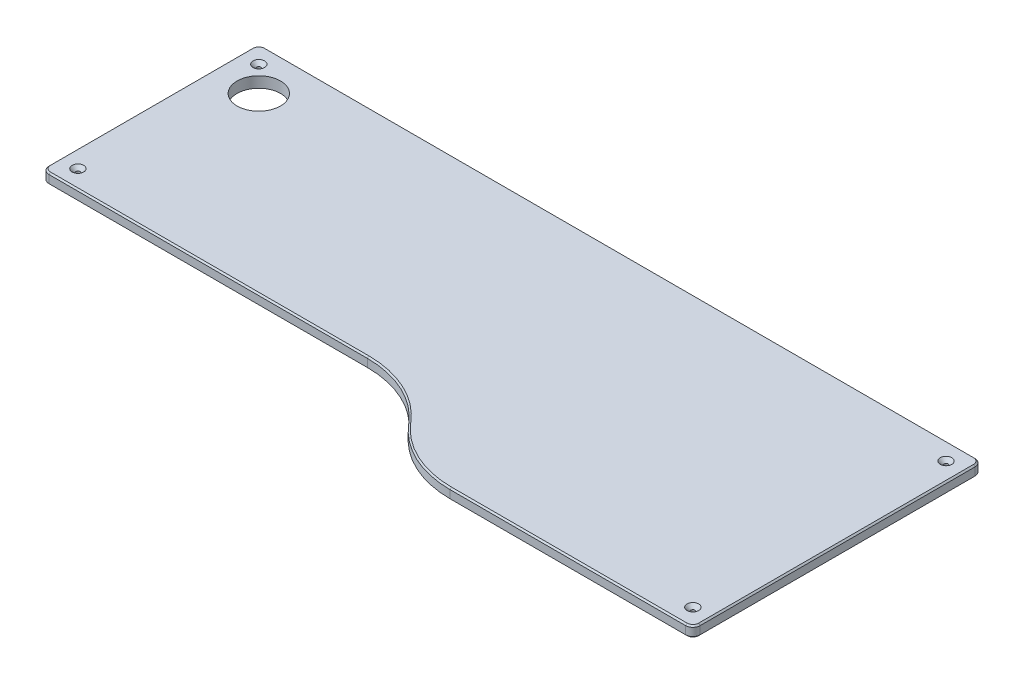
ISO-10303-21;
HEADER;
FILE_DESCRIPTION(('STEP AP214'),'2;1');
FILE_NAME('part.step','',(''),(''),'','','');
FILE_SCHEMA(('AUTOMOTIVE_DESIGN { 1 0 10303 214 1 1 1 1 }'));
ENDSEC;
DATA;
#1=APPLICATION_CONTEXT('core data for automotive mechanical design processes');
#2=APPLICATION_PROTOCOL_DEFINITION('international standard','automotive_design',2000,#1);
#3=PRODUCT_CONTEXT('',#1,'mechanical');
#4=PRODUCT('Part','Part','',(#3));
#5=PRODUCT_RELATED_PRODUCT_CATEGORY('part','',(#4));
#6=PRODUCT_DEFINITION_FORMATION('','',#4);
#7=PRODUCT_DEFINITION_CONTEXT('part definition',#1,'design');
#8=PRODUCT_DEFINITION('design','',#6,#7);
#9=PRODUCT_DEFINITION_SHAPE('','',#8);
#10=(LENGTH_UNIT() NAMED_UNIT(*) SI_UNIT(.MILLI.,.METRE.));
#11=(NAMED_UNIT(*) PLANE_ANGLE_UNIT() SI_UNIT($,.RADIAN.));
#12=(NAMED_UNIT(*) SI_UNIT($,.STERADIAN.) SOLID_ANGLE_UNIT());
#13=UNCERTAINTY_MEASURE_WITH_UNIT(LENGTH_MEASURE(1.E-05),#10,'distance_accuracy_value','');
#14=(GEOMETRIC_REPRESENTATION_CONTEXT(3) GLOBAL_UNCERTAINTY_ASSIGNED_CONTEXT((#13)) GLOBAL_UNIT_ASSIGNED_CONTEXT((#10,
#11,#12)) REPRESENTATION_CONTEXT('',''));
#15=CARTESIAN_POINT('',(0.,0.,0.));
#16=DIRECTION('',(0.,0.,1.));
#17=DIRECTION('',(1.,0.,0.));
#18=AXIS2_PLACEMENT_3D('',#15,#16,#17);
#19=CARTESIAN_POINT('',(-50.,15.,240.));
#20=DIRECTION('',(0.,-1.,0.));
#21=DIRECTION('',(0.,0.,-1.));
#22=AXIS2_PLACEMENT_3D('',#19,#20,#21);
#23=PLANE('',#22);
#24=DIRECTION('',(1.,0.,0.));
#25=VECTOR('',#24,1.);
#26=CARTESIAN_POINT('',(-50.,15.,198.));
#27=LINE('',#26,#25);
#28=CARTESIAN_POINT('',(164.476105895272,15.,198.));
#29=VERTEX_POINT('',#28);
#30=CARTESIAN_POINT('',(490.,15.,198.));
#31=VERTEX_POINT('',#30);
#32=EDGE_CURVE('E277',#29,#31,#27,.T.);
#33=ORIENTED_EDGE('',*,*,#32,.T.);
#34=CARTESIAN_POINT('',(490.,15.,190.));
#35=DIRECTION('',(0.,-1.,0.));
#36=DIRECTION('',(0.,0.,-1.));
#37=AXIS2_PLACEMENT_3D('',#34,#35,#36);
#38=CIRCLE('',#37,8.00000000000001);
#39=CARTESIAN_POINT('',(498.,15.,190.));
#40=VERTEX_POINT('',#39);
#41=EDGE_CURVE('E11',#31,#40,#38,.F.);
#42=ORIENTED_EDGE('',*,*,#41,.T.);
#43=DIRECTION('',(0.,0.,-1.));
#44=VECTOR('',#43,1.);
#45=CARTESIAN_POINT('',(498.,15.,240.));
#46=LINE('',#45,#44);
#47=CARTESIAN_POINT('',(498.,15.,-190.));
#48=VERTEX_POINT('',#47);
#49=EDGE_CURVE('E39',#40,#48,#46,.T.);
#50=ORIENTED_EDGE('',*,*,#49,.T.);
#51=CARTESIAN_POINT('',(490.,15.,-190.));
#52=DIRECTION('',(0.,-1.,0.));
#53=DIRECTION('',(0.,0.,-1.));
#54=AXIS2_PLACEMENT_3D('',#51,#52,#53);
#55=CIRCLE('',#54,8.00000000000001);
#56=CARTESIAN_POINT('',(490.,15.,-198.));
#57=VERTEX_POINT('',#56);
#58=EDGE_CURVE('E275',#48,#57,#55,.F.);
#59=ORIENTED_EDGE('',*,*,#58,.T.);
#60=DIRECTION('',(-1.,0.,0.));
#61=VECTOR('',#60,1.);
#62=CARTESIAN_POINT('',(-50.,15.,-198.));
#63=LINE('',#62,#61);
#64=CARTESIAN_POINT('',(-490.,15.,-198.));
#65=VERTEX_POINT('',#64);
#66=EDGE_CURVE('E283',#57,#65,#63,.T.);
#67=ORIENTED_EDGE('',*,*,#66,.T.);
#68=CARTESIAN_POINT('',(-490.,15.,-190.));
#69=DIRECTION('',(0.,-1.,0.));
#70=DIRECTION('',(0.,0.,-1.));
#71=AXIS2_PLACEMENT_3D('',#68,#69,#70);
#72=CIRCLE('',#71,8.00000000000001);
#73=CARTESIAN_POINT('',(-498.,15.,-190.));
#74=VERTEX_POINT('',#73);
#75=EDGE_CURVE('E285',#65,#74,#72,.F.);
#76=ORIENTED_EDGE('',*,*,#75,.T.);
#77=DIRECTION('',(0.,0.,1.));
#78=VECTOR('',#77,1.);
#79=CARTESIAN_POINT('',(-498.,15.,240.));
#80=LINE('',#79,#78);
#81=CARTESIAN_POINT('',(-498.,15.,90.));
#82=VERTEX_POINT('',#81);
#83=EDGE_CURVE('E290',#74,#82,#80,.T.);
#84=ORIENTED_EDGE('',*,*,#83,.T.);
#85=CARTESIAN_POINT('',(-490.,15.,90.));
#86=DIRECTION('',(0.,-1.,0.));
#87=DIRECTION('',(0.,0.,-1.));
#88=AXIS2_PLACEMENT_3D('',#85,#86,#87);
#89=CIRCLE('',#88,8.00000000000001);
#90=CARTESIAN_POINT('',(-490.,15.,98.));
#91=VERTEX_POINT('',#90);
#92=EDGE_CURVE('E288',#82,#91,#89,.F.);
#93=ORIENTED_EDGE('',*,*,#92,.T.);
#94=DIRECTION('',(1.,0.,0.));
#95=VECTOR('',#94,1.);
#96=CARTESIAN_POINT('',(-50.,15.,98.));
#97=LINE('',#96,#95);
#98=CARTESIAN_POINT('',(-50.,15.,98.));
#99=VERTEX_POINT('',#98);
#100=EDGE_CURVE('E217',#91,#99,#97,.T.);
#101=ORIENTED_EDGE('',*,*,#100,.T.);
#102=CARTESIAN_POINT('',(-50.,15.,240.));
#103=DIRECTION('',(0.,-1.,0.));
#104=DIRECTION('',(0.,0.,-1.));
#105=AXIS2_PLACEMENT_3D('',#102,#103,#104);
#106=CIRCLE('',#105,142.);
#107=CARTESIAN_POINT('',(58.7700251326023,15.,148.714285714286));
#108=VERTEX_POINT('',#107);
#109=EDGE_CURVE('E281',#99,#108,#106,.T.);
#110=ORIENTED_EDGE('',*,*,#109,.T.);
#111=CARTESIAN_POINT('',(164.476105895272,15.,60.0000000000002));
#112=DIRECTION('',(0.,-1.,0.));
#113=DIRECTION('',(0.,0.,-1.));
#114=AXIS2_PLACEMENT_3D('',#111,#112,#113);
#115=CIRCLE('',#114,138.);
#116=EDGE_CURVE('E279',#108,#29,#115,.F.);
#117=ORIENTED_EDGE('',*,*,#116,.T.);
#118=EDGE_LOOP('',(#33,#42,#50,#59,#67,#76,#84,#93,#101,#110,#117));
#119=FACE_BOUND('',#118,.T.);
#120=CARTESIAN_POINT('',(-440.,15.,-140.));
#121=DIRECTION('',(0.,1.,0.));
#122=DIRECTION('',(0.,0.,1.));
#123=AXIS2_PLACEMENT_3D('',#120,#121,#122);
#124=CIRCLE('',#123,30.);
#125=CARTESIAN_POINT('',(-440.,15.,-110.));
#126=VERTEX_POINT('',#125);
#127=EDGE_CURVE('E246',#126,#126,#124,.T.);
#128=ORIENTED_EDGE('',*,*,#127,.F.);
#129=EDGE_LOOP('',(#128));
#130=FACE_BOUND('',#129,.T.);
#131=CARTESIAN_POINT('',(475.,15.,-175.));
#132=DIRECTION('',(0.,-1.,0.));
#133=DIRECTION('',(0.,0.,-1.));
#134=AXIS2_PLACEMENT_3D('',#131,#132,#133);
#135=CIRCLE('',#134,8.00000000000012);
#136=CARTESIAN_POINT('',(475.,15.,-183.));
#137=VERTEX_POINT('',#136);
#138=EDGE_CURVE('E361',#137,#137,#135,.T.);
#139=ORIENTED_EDGE('',*,*,#138,.T.);
#140=EDGE_LOOP('',(#139));
#141=FACE_BOUND('',#140,.T.);
#142=CARTESIAN_POINT('',(475.,15.,175.));
#143=DIRECTION('',(0.,-1.,0.));
#144=DIRECTION('',(0.,0.,-1.));
#145=AXIS2_PLACEMENT_3D('',#142,#143,#144);
#146=CIRCLE('',#145,8.00000000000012);
#147=CARTESIAN_POINT('',(475.,15.,167.));
#148=VERTEX_POINT('',#147);
#149=EDGE_CURVE('E364',#148,#148,#146,.T.);
#150=ORIENTED_EDGE('',*,*,#149,.T.);
#151=EDGE_LOOP('',(#150));
#152=FACE_BOUND('',#151,.T.);
#153=CARTESIAN_POINT('',(-475.,15.,75.));
#154=DIRECTION('',(0.,-1.,0.));
#155=DIRECTION('',(0.,0.,-1.));
#156=AXIS2_PLACEMENT_3D('',#153,#154,#155);
#157=CIRCLE('',#156,8.00000000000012);
#158=CARTESIAN_POINT('',(-475.,15.,66.9999999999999));
#159=VERTEX_POINT('',#158);
#160=EDGE_CURVE('E367',#159,#159,#157,.T.);
#161=ORIENTED_EDGE('',*,*,#160,.T.);
#162=EDGE_LOOP('',(#161));
#163=FACE_BOUND('',#162,.T.);
#164=CARTESIAN_POINT('',(-475.,15.,-175.));
#165=DIRECTION('',(0.,-1.,0.));
#166=DIRECTION('',(0.,0.,-1.));
#167=AXIS2_PLACEMENT_3D('',#164,#165,#166);
#168=CIRCLE('',#167,8.00000000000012);
#169=CARTESIAN_POINT('',(-475.,15.,-183.));
#170=VERTEX_POINT('',#169);
#171=EDGE_CURVE('E370',#170,#170,#168,.T.);
#172=ORIENTED_EDGE('',*,*,#171,.T.);
#173=EDGE_LOOP('',(#172));
#174=FACE_BOUND('',#173,.T.);
#175=ADVANCED_FACE('F30',(#119,#130,#141,#152,#163,#174),#23,.F.);
#176=CARTESIAN_POINT('',(-50.,0.,240.));
#177=DIRECTION('',(0.,-1.,0.));
#178=DIRECTION('',(0.,0.,-1.));
#179=AXIS2_PLACEMENT_3D('',#176,#177,#178);
#180=PLANE('',#179);
#181=DIRECTION('',(-1.,0.,0.));
#182=VECTOR('',#181,1.);
#183=CARTESIAN_POINT('',(-490.,0.,97.9999999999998));
#184=LINE('',#183,#182);
#185=CARTESIAN_POINT('',(-50.,0.,97.9999999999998));
#186=VERTEX_POINT('',#185);
#187=CARTESIAN_POINT('',(-490.,0.,97.9999999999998));
#188=VERTEX_POINT('',#187);
#189=EDGE_CURVE('E344',#186,#188,#184,.T.);
#190=ORIENTED_EDGE('',*,*,#189,.T.);
#191=CARTESIAN_POINT('',(-490.,0.,90.));
#192=DIRECTION('',(0.,-1.,0.));
#193=DIRECTION('',(0.,0.,-1.));
#194=AXIS2_PLACEMENT_3D('',#191,#192,#193);
#195=CIRCLE('',#194,7.99999999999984);
#196=CARTESIAN_POINT('',(-498.,0.,90.));
#197=VERTEX_POINT('',#196);
#198=EDGE_CURVE('E329',#188,#197,#195,.T.);
#199=ORIENTED_EDGE('',*,*,#198,.T.);
#200=DIRECTION('',(0.,0.,-1.));
#201=VECTOR('',#200,1.);
#202=CARTESIAN_POINT('',(-498.,0.,-190.));
#203=LINE('',#202,#201);
#204=CARTESIAN_POINT('',(-498.,0.,-190.));
#205=VERTEX_POINT('',#204);
#206=EDGE_CURVE('E332',#197,#205,#203,.T.);
#207=ORIENTED_EDGE('',*,*,#206,.T.);
#208=CARTESIAN_POINT('',(-490.,0.,-190.));
#209=DIRECTION('',(0.,-1.,0.));
#210=DIRECTION('',(0.,0.,-1.));
#211=AXIS2_PLACEMENT_3D('',#208,#209,#210);
#212=CIRCLE('',#211,7.99999999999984);
#213=CARTESIAN_POINT('',(-490.,0.,-198.));
#214=VERTEX_POINT('',#213);
#215=EDGE_CURVE('E334',#205,#214,#212,.T.);
#216=ORIENTED_EDGE('',*,*,#215,.T.);
#217=DIRECTION('',(1.,0.,0.));
#218=VECTOR('',#217,1.);
#219=CARTESIAN_POINT('',(490.,0.,-198.));
#220=LINE('',#219,#218);
#221=CARTESIAN_POINT('',(490.,0.,-198.));
#222=VERTEX_POINT('',#221);
#223=EDGE_CURVE('E336',#214,#222,#220,.T.);
#224=ORIENTED_EDGE('',*,*,#223,.T.);
#225=CARTESIAN_POINT('',(490.,0.,-190.));
#226=DIRECTION('',(0.,-1.,0.));
#227=DIRECTION('',(0.,0.,-1.));
#228=AXIS2_PLACEMENT_3D('',#225,#226,#227);
#229=CIRCLE('',#228,7.99999999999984);
#230=CARTESIAN_POINT('',(498.,0.,-190.));
#231=VERTEX_POINT('',#230);
#232=EDGE_CURVE('E338',#222,#231,#229,.T.);
#233=ORIENTED_EDGE('',*,*,#232,.T.);
#234=DIRECTION('',(0.,0.,1.));
#235=VECTOR('',#234,1.);
#236=CARTESIAN_POINT('',(498.,0.,190.));
#237=LINE('',#236,#235);
#238=CARTESIAN_POINT('',(498.,0.,190.));
#239=VERTEX_POINT('',#238);
#240=EDGE_CURVE('E340',#231,#239,#237,.T.);
#241=ORIENTED_EDGE('',*,*,#240,.T.);
#242=CARTESIAN_POINT('',(490.,0.,190.));
#243=DIRECTION('',(0.,-1.,0.));
#244=DIRECTION('',(0.,0.,-1.));
#245=AXIS2_PLACEMENT_3D('',#242,#243,#244);
#246=CIRCLE('',#245,7.99999999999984);
#247=CARTESIAN_POINT('',(490.,0.,198.));
#248=VERTEX_POINT('',#247);
#249=EDGE_CURVE('E342',#239,#248,#246,.T.);
#250=ORIENTED_EDGE('',*,*,#249,.T.);
#251=DIRECTION('',(-1.,0.,0.));
#252=VECTOR('',#251,1.);
#253=CARTESIAN_POINT('',(164.476105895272,0.,198.));
#254=LINE('',#253,#252);
#255=CARTESIAN_POINT('',(164.476105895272,0.,198.));
#256=VERTEX_POINT('',#255);
#257=EDGE_CURVE('E346',#248,#256,#254,.T.);
#258=ORIENTED_EDGE('',*,*,#257,.T.);
#259=CARTESIAN_POINT('',(164.476105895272,0.,60.0000000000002));
#260=DIRECTION('',(0.,-1.,0.));
#261=DIRECTION('',(0.,0.,-1.));
#262=AXIS2_PLACEMENT_3D('',#259,#260,#261);
#263=CIRCLE('',#262,138.);
#264=CARTESIAN_POINT('',(58.7700251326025,0.,148.714285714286));
#265=VERTEX_POINT('',#264);
#266=EDGE_CURVE('E348',#256,#265,#263,.T.);
#267=ORIENTED_EDGE('',*,*,#266,.T.);
#268=CARTESIAN_POINT('',(-50.,0.,240.));
#269=DIRECTION('',(0.,-1.,0.));
#270=DIRECTION('',(0.,0.,-1.));
#271=AXIS2_PLACEMENT_3D('',#268,#269,#270);
#272=CIRCLE('',#271,142.);
#273=EDGE_CURVE('E350',#265,#186,#272,.F.);
#274=ORIENTED_EDGE('',*,*,#273,.T.);
#275=EDGE_LOOP('',(#190,#199,#207,#216,#224,#233,#241,#250,#258,#267,#274));
#276=FACE_BOUND('',#275,.T.);
#277=CARTESIAN_POINT('',(-440.,0.,-140.));
#278=DIRECTION('',(0.,1.,0.));
#279=DIRECTION('',(0.,0.,1.));
#280=AXIS2_PLACEMENT_3D('',#277,#278,#279);
#281=CIRCLE('',#280,30.);
#282=CARTESIAN_POINT('',(-440.,0.,-110.));
#283=VERTEX_POINT('',#282);
#284=EDGE_CURVE('E436',#283,#283,#281,.T.);
#285=ORIENTED_EDGE('',*,*,#284,.T.);
#286=EDGE_LOOP('',(#285));
#287=FACE_BOUND('',#286,.T.);
#288=CARTESIAN_POINT('',(472.5,0.,70.));
#289=DIRECTION('',(0.,-1.,0.));
#290=DIRECTION('',(0.,0.,1.));
#291=AXIS2_PLACEMENT_3D('',#288,#289,#290);
#292=CIRCLE('',#291,1.99999999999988);
#293=CARTESIAN_POINT('',(472.5,0.,71.9999999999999));
#294=VERTEX_POINT('',#293);
#295=EDGE_CURVE('E433',#294,#294,#292,.T.);
#296=ORIENTED_EDGE('',*,*,#295,.F.);
#297=EDGE_LOOP('',(#296));
#298=FACE_BOUND('',#297,.T.);
#299=CARTESIAN_POINT('',(472.5,0.,-80.));
#300=DIRECTION('',(0.,-1.,0.));
#301=DIRECTION('',(0.,0.,-1.));
#302=AXIS2_PLACEMENT_3D('',#299,#300,#301);
#303=CIRCLE('',#302,1.99999999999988);
#304=CARTESIAN_POINT('',(472.5,0.,-81.9999999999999));
#305=VERTEX_POINT('',#304);
#306=EDGE_CURVE('E427',#305,#305,#303,.T.);
#307=ORIENTED_EDGE('',*,*,#306,.F.);
#308=EDGE_LOOP('',(#307));
#309=FACE_BOUND('',#308,.T.);
#310=CARTESIAN_POINT('',(168.5,0.,-75.));
#311=DIRECTION('',(0.,-1.,0.));
#312=DIRECTION('',(0.,0.,1.));
#313=AXIS2_PLACEMENT_3D('',#310,#311,#312);
#314=CIRCLE('',#313,2.);
#315=CARTESIAN_POINT('',(168.5,0.,-73.));
#316=VERTEX_POINT('',#315);
#317=EDGE_CURVE('E421',#316,#316,#314,.T.);
#318=ORIENTED_EDGE('',*,*,#317,.F.);
#319=EDGE_LOOP('',(#318));
#320=FACE_BOUND('',#319,.T.);
#321=CARTESIAN_POINT('',(168.5,0.,75.));
#322=DIRECTION('',(0.,-1.,0.));
#323=DIRECTION('',(0.,0.,-1.));
#324=AXIS2_PLACEMENT_3D('',#321,#322,#323);
#325=CIRCLE('',#324,2.);
#326=CARTESIAN_POINT('',(168.5,0.,73.));
#327=VERTEX_POINT('',#326);
#328=EDGE_CURVE('E415',#327,#327,#325,.T.);
#329=ORIENTED_EDGE('',*,*,#328,.F.);
#330=EDGE_LOOP('',(#329));
#331=FACE_BOUND('',#330,.T.);
#332=CARTESIAN_POINT('',(475.,0.,-175.));
#333=DIRECTION('',(0.,1.,0.));
#334=DIRECTION('',(0.,0.,1.));
#335=AXIS2_PLACEMENT_3D('',#332,#333,#334);
#336=CIRCLE('',#335,2.99999999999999);
#337=CARTESIAN_POINT('',(475.,0.,-172.));
#338=VERTEX_POINT('',#337);
#339=EDGE_CURVE('E408',#338,#338,#336,.T.);
#340=ORIENTED_EDGE('',*,*,#339,.T.);
#341=EDGE_LOOP('',(#340));
#342=FACE_BOUND('',#341,.T.);
#343=CARTESIAN_POINT('',(-475.,0.,75.));
#344=DIRECTION('',(0.,1.,0.));
#345=DIRECTION('',(0.,0.,1.));
#346=AXIS2_PLACEMENT_3D('',#343,#344,#345);
#347=CIRCLE('',#346,2.99999999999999);
#348=CARTESIAN_POINT('',(-475.,0.,78.));
#349=VERTEX_POINT('',#348);
#350=EDGE_CURVE('E402',#349,#349,#347,.T.);
#351=ORIENTED_EDGE('',*,*,#350,.T.);
#352=EDGE_LOOP('',(#351));
#353=FACE_BOUND('',#352,.T.);
#354=CARTESIAN_POINT('',(-475.,0.,-175.));
#355=DIRECTION('',(0.,1.,0.));
#356=DIRECTION('',(0.,0.,-1.));
#357=AXIS2_PLACEMENT_3D('',#354,#355,#356);
#358=CIRCLE('',#357,2.99999999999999);
#359=CARTESIAN_POINT('',(-475.,0.,-178.));
#360=VERTEX_POINT('',#359);
#361=EDGE_CURVE('E405',#360,#360,#358,.T.);
#362=ORIENTED_EDGE('',*,*,#361,.T.);
#363=EDGE_LOOP('',(#362));
#364=FACE_BOUND('',#363,.T.);
#365=CARTESIAN_POINT('',(475.,0.,175.));
#366=DIRECTION('',(0.,1.,0.));
#367=DIRECTION('',(0.,0.,-1.));
#368=AXIS2_PLACEMENT_3D('',#365,#366,#367);
#369=CIRCLE('',#368,2.99999999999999);
#370=CARTESIAN_POINT('',(475.,0.,172.));
#371=VERTEX_POINT('',#370);
#372=EDGE_CURVE('E411',#371,#371,#369,.T.);
#373=ORIENTED_EDGE('',*,*,#372,.T.);
#374=EDGE_LOOP('',(#373));
#375=FACE_BOUND('',#374,.T.);
#376=ADVANCED_FACE('F444',(#276,#287,#298,#309,#320,#331,#342,#353,#364,#375),#180,.T.);
#377=CARTESIAN_POINT('',(-50.,15.,240.));
#378=DIRECTION('',(0.,-1.,0.));
#379=DIRECTION('',(0.,0.,-1.));
#380=AXIS2_PLACEMENT_3D('',#377,#378,#379);
#381=CYLINDRICAL_SURFACE('',#380,140.);
#382=DIRECTION('',(0.,-1.,0.));
#383=VECTOR('',#382,1.);
#384=CARTESIAN_POINT('',(-50.,15.,100.));
#385=LINE('',#384,#383);
#386=CARTESIAN_POINT('',(-50.,13.,100.));
#387=VERTEX_POINT('',#386);
#388=CARTESIAN_POINT('',(-50.,2.00000000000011,100.));
#389=VERTEX_POINT('',#388);
#390=EDGE_CURVE('E187',#387,#389,#385,.T.);
#391=ORIENTED_EDGE('',*,*,#390,.T.);
#392=CARTESIAN_POINT('',(-50.,2.00000000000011,240.));
#393=DIRECTION('',(0.,-1.,0.));
#394=DIRECTION('',(0.,0.,-1.));
#395=AXIS2_PLACEMENT_3D('',#392,#393,#394);
#396=CIRCLE('',#395,140.);
#397=CARTESIAN_POINT('',(57.2380529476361,2.00000000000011,150.));
#398=VERTEX_POINT('',#397);
#399=EDGE_CURVE('E292',#389,#398,#396,.T.);
#400=ORIENTED_EDGE('',*,*,#399,.T.);
#401=DIRECTION('',(0.,-1.,0.));
#402=VECTOR('',#401,1.);
#403=CARTESIAN_POINT('',(57.2380529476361,15.,150.));
#404=LINE('',#403,#402);
#405=CARTESIAN_POINT('',(57.2380529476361,13.,150.));
#406=VERTEX_POINT('',#405);
#407=EDGE_CURVE('E376',#406,#398,#404,.T.);
#408=ORIENTED_EDGE('',*,*,#407,.F.);
#409=CARTESIAN_POINT('',(-50.,13.,240.));
#410=DIRECTION('',(0.,-1.,0.));
#411=DIRECTION('',(0.,0.,-1.));
#412=AXIS2_PLACEMENT_3D('',#409,#410,#411);
#413=CIRCLE('',#412,140.);
#414=EDGE_CURVE('E294',#406,#387,#413,.F.);
#415=ORIENTED_EDGE('',*,*,#414,.T.);
#416=EDGE_LOOP('',(#391,#400,#408,#415));
#417=FACE_BOUND('',#416,.T.);
#418=ADVANCED_FACE('F484',(#417),#381,.F.);
#419=CARTESIAN_POINT('',(164.476105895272,15.,60.0000000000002));
#420=DIRECTION('',(0.,-1.,0.));
#421=DIRECTION('',(0.,0.,-1.));
#422=AXIS2_PLACEMENT_3D('',#419,#420,#421);
#423=CYLINDRICAL_SURFACE('',#422,140.);
#424=ORIENTED_EDGE('',*,*,#407,.T.);
#425=CARTESIAN_POINT('',(164.476105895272,2.00000000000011,60.0000000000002));
#426=DIRECTION('',(0.,-1.,0.));
#427=DIRECTION('',(0.,0.,-1.));
#428=AXIS2_PLACEMENT_3D('',#425,#426,#427);
#429=CIRCLE('',#428,140.);
#430=CARTESIAN_POINT('',(164.476105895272,2.00000000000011,200.));
#431=VERTEX_POINT('',#430);
#432=EDGE_CURVE('E296',#398,#431,#429,.F.);
#433=ORIENTED_EDGE('',*,*,#432,.T.);
#434=DIRECTION('',(0.,-1.,0.));
#435=VECTOR('',#434,1.);
#436=CARTESIAN_POINT('',(164.476105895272,15.,200.));
#437=LINE('',#436,#435);
#438=CARTESIAN_POINT('',(164.476105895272,13.,200.));
#439=VERTEX_POINT('',#438);
#440=EDGE_CURVE('E379',#439,#431,#437,.T.);
#441=ORIENTED_EDGE('',*,*,#440,.F.);
#442=CARTESIAN_POINT('',(164.476105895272,13.,60.0000000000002));
#443=DIRECTION('',(0.,-1.,0.));
#444=DIRECTION('',(0.,0.,-1.));
#445=AXIS2_PLACEMENT_3D('',#442,#443,#444);
#446=CIRCLE('',#445,140.);
#447=EDGE_CURVE('E298',#439,#406,#446,.T.);
#448=ORIENTED_EDGE('',*,*,#447,.T.);
#449=EDGE_LOOP('',(#424,#433,#441,#448));
#450=FACE_BOUND('',#449,.T.);
#451=ADVANCED_FACE('F540',(#450),#423,.T.);
#452=CARTESIAN_POINT('',(164.476105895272,15.,200.));
#453=DIRECTION('',(0.,0.,-1.));
#454=DIRECTION('',(-1.,0.,0.));
#455=AXIS2_PLACEMENT_3D('',#452,#453,#454);
#456=PLANE('',#455);
#457=ORIENTED_EDGE('',*,*,#440,.T.);
#458=DIRECTION('',(1.,0.,0.));
#459=VECTOR('',#458,1.);
#460=CARTESIAN_POINT('',(490.,2.00000000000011,200.));
#461=LINE('',#460,#459);
#462=CARTESIAN_POINT('',(490.,2.00000000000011,200.));
#463=VERTEX_POINT('',#462);
#464=EDGE_CURVE('E300',#431,#463,#461,.T.);
#465=ORIENTED_EDGE('',*,*,#464,.T.);
#466=DIRECTION('',(0.,-1.,0.));
#467=VECTOR('',#466,1.);
#468=CARTESIAN_POINT('',(490.,15.,200.));
#469=LINE('',#468,#467);
#470=CARTESIAN_POINT('',(490.,13.,200.));
#471=VERTEX_POINT('',#470);
#472=EDGE_CURVE('E382',#471,#463,#469,.T.);
#473=ORIENTED_EDGE('',*,*,#472,.F.);
#474=DIRECTION('',(-1.,0.,0.));
#475=VECTOR('',#474,1.);
#476=CARTESIAN_POINT('',(164.476105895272,13.,200.));
#477=LINE('',#476,#475);
#478=EDGE_CURVE('E302',#471,#439,#477,.T.);
#479=ORIENTED_EDGE('',*,*,#478,.T.);
#480=EDGE_LOOP('',(#457,#465,#473,#479));
#481=FACE_BOUND('',#480,.T.);
#482=ADVANCED_FACE('F536',(#481),#456,.F.);
#483=CARTESIAN_POINT('',(490.,15.,190.));
#484=DIRECTION('',(0.,-1.,0.));
#485=DIRECTION('',(0.,0.,-1.));
#486=AXIS2_PLACEMENT_3D('',#483,#484,#485);
#487=CYLINDRICAL_SURFACE('',#486,10.);
#488=ORIENTED_EDGE('',*,*,#472,.T.);
#489=CARTESIAN_POINT('',(490.,2.00000000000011,190.));
#490=DIRECTION('',(0.,-1.,0.));
#491=DIRECTION('',(0.,0.,-1.));
#492=AXIS2_PLACEMENT_3D('',#489,#490,#491);
#493=CIRCLE('',#492,10.);
#494=CARTESIAN_POINT('',(500.,2.00000000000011,190.));
#495=VERTEX_POINT('',#494);
#496=EDGE_CURVE('E193',#463,#495,#493,.F.);
#497=ORIENTED_EDGE('',*,*,#496,.T.);
#498=DIRECTION('',(0.,-1.,0.));
#499=VECTOR('',#498,1.);
#500=CARTESIAN_POINT('',(500.,15.,190.));
#501=LINE('',#500,#499);
#502=CARTESIAN_POINT('',(500.,13.,190.));
#503=VERTEX_POINT('',#502);
#504=EDGE_CURVE('E385',#503,#495,#501,.T.);
#505=ORIENTED_EDGE('',*,*,#504,.F.);
#506=CARTESIAN_POINT('',(490.,13.,190.));
#507=DIRECTION('',(0.,-1.,0.));
#508=DIRECTION('',(0.,0.,-1.));
#509=AXIS2_PLACEMENT_3D('',#506,#507,#508);
#510=CIRCLE('',#509,10.);
#511=EDGE_CURVE('E306',#503,#471,#510,.T.);
#512=ORIENTED_EDGE('',*,*,#511,.T.);
#513=EDGE_LOOP('',(#488,#497,#505,#512));
#514=FACE_BOUND('',#513,.T.);
#515=ADVANCED_FACE('F532',(#514),#487,.T.);
#516=CARTESIAN_POINT('',(500.,15.,190.));
#517=DIRECTION('',(-1.,0.,0.));
#518=DIRECTION('',(0.,0.,1.));
#519=AXIS2_PLACEMENT_3D('',#516,#517,#518);
#520=PLANE('',#519);
#521=ORIENTED_EDGE('',*,*,#504,.T.);
#522=DIRECTION('',(0.,0.,-1.));
#523=VECTOR('',#522,1.);
#524=CARTESIAN_POINT('',(500.,2.00000000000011,-190.));
#525=LINE('',#524,#523);
#526=CARTESIAN_POINT('',(500.,2.00000000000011,-190.));
#527=VERTEX_POINT('',#526);
#528=EDGE_CURVE('E309',#495,#527,#525,.T.);
#529=ORIENTED_EDGE('',*,*,#528,.T.);
#530=DIRECTION('',(0.,-1.,0.));
#531=VECTOR('',#530,1.);
#532=CARTESIAN_POINT('',(500.,15.,-190.));
#533=LINE('',#532,#531);
#534=CARTESIAN_POINT('',(500.,13.,-190.));
#535=VERTEX_POINT('',#534);
#536=EDGE_CURVE('E388',#535,#527,#533,.T.);
#537=ORIENTED_EDGE('',*,*,#536,.F.);
#538=DIRECTION('',(0.,0.,1.));
#539=VECTOR('',#538,1.);
#540=CARTESIAN_POINT('',(500.,13.,190.));
#541=LINE('',#540,#539);
#542=EDGE_CURVE('E311',#535,#503,#541,.T.);
#543=ORIENTED_EDGE('',*,*,#542,.T.);
#544=EDGE_LOOP('',(#521,#529,#537,#543));
#545=FACE_BOUND('',#544,.T.);
#546=ADVANCED_FACE('F528',(#545),#520,.F.);
#547=CARTESIAN_POINT('',(490.,15.,-190.));
#548=DIRECTION('',(0.,-1.,0.));
#549=DIRECTION('',(0.,0.,-1.));
#550=AXIS2_PLACEMENT_3D('',#547,#548,#549);
#551=CYLINDRICAL_SURFACE('',#550,10.);
#552=ORIENTED_EDGE('',*,*,#536,.T.);
#553=CARTESIAN_POINT('',(490.,2.00000000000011,-190.));
#554=DIRECTION('',(0.,-1.,0.));
#555=DIRECTION('',(0.,0.,-1.));
#556=AXIS2_PLACEMENT_3D('',#553,#554,#555);
#557=CIRCLE('',#556,10.);
#558=CARTESIAN_POINT('',(490.,2.00000000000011,-200.));
#559=VERTEX_POINT('',#558);
#560=EDGE_CURVE('E313',#527,#559,#557,.F.);
#561=ORIENTED_EDGE('',*,*,#560,.T.);
#562=DIRECTION('',(0.,-1.,0.));
#563=VECTOR('',#562,1.);
#564=CARTESIAN_POINT('',(490.,15.,-200.));
#565=LINE('',#564,#563);
#566=CARTESIAN_POINT('',(490.,13.,-200.));
#567=VERTEX_POINT('',#566);
#568=EDGE_CURVE('E391',#567,#559,#565,.T.);
#569=ORIENTED_EDGE('',*,*,#568,.F.);
#570=CARTESIAN_POINT('',(490.,13.,-190.));
#571=DIRECTION('',(0.,-1.,0.));
#572=DIRECTION('',(0.,0.,-1.));
#573=AXIS2_PLACEMENT_3D('',#570,#571,#572);
#574=CIRCLE('',#573,10.);
#575=EDGE_CURVE('E315',#567,#535,#574,.T.);
#576=ORIENTED_EDGE('',*,*,#575,.T.);
#577=EDGE_LOOP('',(#552,#561,#569,#576));
#578=FACE_BOUND('',#577,.T.);
#579=ADVANCED_FACE('F524',(#578),#551,.T.);
#580=CARTESIAN_POINT('',(-490.,15.,-200.));
#581=DIRECTION('',(0.,0.,1.));
#582=DIRECTION('',(1.,0.,0.));
#583=AXIS2_PLACEMENT_3D('',#580,#581,#582);
#584=PLANE('',#583);
#585=ORIENTED_EDGE('',*,*,#568,.T.);
#586=DIRECTION('',(-1.,0.,0.));
#587=VECTOR('',#586,1.);
#588=CARTESIAN_POINT('',(-490.,2.00000000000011,-200.));
#589=LINE('',#588,#587);
#590=CARTESIAN_POINT('',(-490.,2.00000000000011,-200.));
#591=VERTEX_POINT('',#590);
#592=EDGE_CURVE('E317',#559,#591,#589,.T.);
#593=ORIENTED_EDGE('',*,*,#592,.T.);
#594=DIRECTION('',(0.,-1.,0.));
#595=VECTOR('',#594,1.);
#596=CARTESIAN_POINT('',(-490.,15.,-200.));
#597=LINE('',#596,#595);
#598=CARTESIAN_POINT('',(-490.,13.,-200.));
#599=VERTEX_POINT('',#598);
#600=EDGE_CURVE('E394',#599,#591,#597,.T.);
#601=ORIENTED_EDGE('',*,*,#600,.F.);
#602=DIRECTION('',(1.,0.,0.));
#603=VECTOR('',#602,1.);
#604=CARTESIAN_POINT('',(-490.,13.,-200.));
#605=LINE('',#604,#603);
#606=EDGE_CURVE('E319',#599,#567,#605,.T.);
#607=ORIENTED_EDGE('',*,*,#606,.T.);
#608=EDGE_LOOP('',(#585,#593,#601,#607));
#609=FACE_BOUND('',#608,.T.);
#610=ADVANCED_FACE('F520',(#609),#584,.F.);
#611=CARTESIAN_POINT('',(-490.,15.,-190.));
#612=DIRECTION('',(0.,-1.,0.));
#613=DIRECTION('',(0.,0.,-1.));
#614=AXIS2_PLACEMENT_3D('',#611,#612,#613);
#615=CYLINDRICAL_SURFACE('',#614,10.);
#616=ORIENTED_EDGE('',*,*,#600,.T.);
#617=CARTESIAN_POINT('',(-490.,2.00000000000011,-190.));
#618=DIRECTION('',(0.,-1.,0.));
#619=DIRECTION('',(0.,0.,-1.));
#620=AXIS2_PLACEMENT_3D('',#617,#618,#619);
#621=CIRCLE('',#620,10.);
#622=CARTESIAN_POINT('',(-500.,2.00000000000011,-190.));
#623=VERTEX_POINT('',#622);
#624=EDGE_CURVE('E321',#591,#623,#621,.F.);
#625=ORIENTED_EDGE('',*,*,#624,.T.);
#626=DIRECTION('',(0.,-1.,0.));
#627=VECTOR('',#626,1.);
#628=CARTESIAN_POINT('',(-500.,15.,-190.));
#629=LINE('',#628,#627);
#630=CARTESIAN_POINT('',(-500.,13.,-190.));
#631=VERTEX_POINT('',#630);
#632=EDGE_CURVE('E397',#631,#623,#629,.T.);
#633=ORIENTED_EDGE('',*,*,#632,.F.);
#634=CARTESIAN_POINT('',(-490.,13.,-190.));
#635=DIRECTION('',(0.,-1.,0.));
#636=DIRECTION('',(0.,0.,-1.));
#637=AXIS2_PLACEMENT_3D('',#634,#635,#636);
#638=CIRCLE('',#637,10.);
#639=EDGE_CURVE('E323',#631,#599,#638,.T.);
#640=ORIENTED_EDGE('',*,*,#639,.T.);
#641=EDGE_LOOP('',(#616,#625,#633,#640));
#642=FACE_BOUND('',#641,.T.);
#643=ADVANCED_FACE('F516',(#642),#615,.T.);
#644=CARTESIAN_POINT('',(-500.,15.,-190.));
#645=DIRECTION('',(1.,0.,0.));
#646=DIRECTION('',(0.,0.,-1.));
#647=AXIS2_PLACEMENT_3D('',#644,#645,#646);
#648=PLANE('',#647);
#649=ORIENTED_EDGE('',*,*,#632,.T.);
#650=DIRECTION('',(0.,0.,1.));
#651=VECTOR('',#650,1.);
#652=CARTESIAN_POINT('',(-500.,2.00000000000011,89.9999999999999));
#653=LINE('',#652,#651);
#654=CARTESIAN_POINT('',(-500.,2.00000000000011,89.9999999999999));
#655=VERTEX_POINT('',#654);
#656=EDGE_CURVE('E325',#623,#655,#653,.T.);
#657=ORIENTED_EDGE('',*,*,#656,.T.);
#658=DIRECTION('',(0.,-1.,0.));
#659=VECTOR('',#658,1.);
#660=CARTESIAN_POINT('',(-500.,15.,89.9999999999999));
#661=LINE('',#660,#659);
#662=CARTESIAN_POINT('',(-500.,13.,89.9999999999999));
#663=VERTEX_POINT('',#662);
#664=EDGE_CURVE('E204',#663,#655,#661,.T.);
#665=ORIENTED_EDGE('',*,*,#664,.F.);
#666=DIRECTION('',(0.,0.,-1.));
#667=VECTOR('',#666,1.);
#668=CARTESIAN_POINT('',(-500.,13.,-190.));
#669=LINE('',#668,#667);
#670=EDGE_CURVE('E327',#663,#631,#669,.T.);
#671=ORIENTED_EDGE('',*,*,#670,.T.);
#672=EDGE_LOOP('',(#649,#657,#665,#671));
#673=FACE_BOUND('',#672,.T.);
#674=ADVANCED_FACE('F513',(#673),#648,.F.);
#675=CARTESIAN_POINT('',(-490.,15.,90.));
#676=DIRECTION('',(0.,-1.,0.));
#677=DIRECTION('',(0.,0.,-1.));
#678=AXIS2_PLACEMENT_3D('',#675,#676,#677);
#679=CYLINDRICAL_SURFACE('',#678,10.);
#680=ORIENTED_EDGE('',*,*,#664,.T.);
#681=CARTESIAN_POINT('',(-490.,2.00000000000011,90.));
#682=DIRECTION('',(0.,-1.,0.));
#683=DIRECTION('',(0.,0.,-1.));
#684=AXIS2_PLACEMENT_3D('',#681,#682,#683);
#685=CIRCLE('',#684,10.);
#686=CARTESIAN_POINT('',(-490.,2.00000000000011,100.));
#687=VERTEX_POINT('',#686);
#688=EDGE_CURVE('E203',#655,#687,#685,.F.);
#689=ORIENTED_EDGE('',*,*,#688,.T.);
#690=DIRECTION('',(0.,-1.,0.));
#691=VECTOR('',#690,1.);
#692=CARTESIAN_POINT('',(-490.,15.,100.));
#693=LINE('',#692,#691);
#694=CARTESIAN_POINT('',(-490.,13.,100.));
#695=VERTEX_POINT('',#694);
#696=EDGE_CURVE('E185',#695,#687,#693,.T.);
#697=ORIENTED_EDGE('',*,*,#696,.F.);
#698=CARTESIAN_POINT('',(-490.,13.,90.));
#699=DIRECTION('',(0.,-1.,0.));
#700=DIRECTION('',(0.,0.,-1.));
#701=AXIS2_PLACEMENT_3D('',#698,#699,#700);
#702=CIRCLE('',#701,10.);
#703=EDGE_CURVE('E200',#695,#663,#702,.T.);
#704=ORIENTED_EDGE('',*,*,#703,.T.);
#705=EDGE_LOOP('',(#680,#689,#697,#704));
#706=FACE_BOUND('',#705,.T.);
#707=ADVANCED_FACE('F199',(#706),#679,.T.);
#708=CARTESIAN_POINT('',(-490.,15.,100.));
#709=DIRECTION('',(0.,0.,-1.));
#710=DIRECTION('',(-1.,0.,0.));
#711=AXIS2_PLACEMENT_3D('',#708,#709,#710);
#712=PLANE('',#711);
#713=ORIENTED_EDGE('',*,*,#696,.T.);
#714=DIRECTION('',(1.,0.,0.));
#715=VECTOR('',#714,1.);
#716=CARTESIAN_POINT('',(-50.,2.00000000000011,100.));
#717=LINE('',#716,#715);
#718=EDGE_CURVE('E192',#687,#389,#717,.T.);
#719=ORIENTED_EDGE('',*,*,#718,.T.);
#720=ORIENTED_EDGE('',*,*,#390,.F.);
#721=DIRECTION('',(-1.,0.,0.));
#722=VECTOR('',#721,1.);
#723=CARTESIAN_POINT('',(-490.,13.,100.));
#724=LINE('',#723,#722);
#725=EDGE_CURVE('E182',#387,#695,#724,.T.);
#726=ORIENTED_EDGE('',*,*,#725,.T.);
#727=EDGE_LOOP('',(#713,#719,#720,#726));
#728=FACE_BOUND('',#727,.T.);
#729=ADVANCED_FACE('F184',(#728),#712,.F.);
#730=CARTESIAN_POINT('',(-475.,15.,75.));
#731=DIRECTION('',(0.,-1.,0.));
#732=DIRECTION('',(0.,0.,-1.));
#733=AXIS2_PLACEMENT_3D('',#730,#731,#732);
#734=CYLINDRICAL_SURFACE('',#733,2.99999999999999);
#735=CARTESIAN_POINT('',(-475.,9.99999999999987,75.));
#736=DIRECTION('',(0.,-1.,0.));
#737=DIRECTION('',(0.,0.,-1.));
#738=AXIS2_PLACEMENT_3D('',#735,#736,#737);
#739=CIRCLE('',#738,2.99999999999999);
#740=CARTESIAN_POINT('',(-475.,9.99999999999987,72.));
#741=VERTEX_POINT('',#740);
#742=EDGE_CURVE('E355',#741,#741,#739,.F.);
#743=ORIENTED_EDGE('',*,*,#742,.T.);
#744=EDGE_LOOP('',(#743));
#745=FACE_BOUND('',#744,.T.);
#746=ORIENTED_EDGE('',*,*,#350,.F.);
#747=EDGE_LOOP('',(#746));
#748=FACE_BOUND('',#747,.T.);
#749=ADVANCED_FACE('F478',(#745,#748),#734,.F.);
#750=CARTESIAN_POINT('',(-475.,15.,-175.));
#751=DIRECTION('',(0.,-1.,0.));
#752=DIRECTION('',(0.,0.,-1.));
#753=AXIS2_PLACEMENT_3D('',#750,#751,#752);
#754=CYLINDRICAL_SURFACE('',#753,2.99999999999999);
#755=CARTESIAN_POINT('',(-475.,9.99999999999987,-175.));
#756=DIRECTION('',(0.,-1.,0.));
#757=DIRECTION('',(0.,0.,-1.));
#758=AXIS2_PLACEMENT_3D('',#755,#756,#757);
#759=CIRCLE('',#758,2.99999999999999);
#760=CARTESIAN_POINT('',(-475.,9.99999999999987,-178.));
#761=VERTEX_POINT('',#760);
#762=EDGE_CURVE('E214',#761,#761,#759,.F.);
#763=ORIENTED_EDGE('',*,*,#762,.T.);
#764=EDGE_LOOP('',(#763));
#765=FACE_BOUND('',#764,.T.);
#766=ORIENTED_EDGE('',*,*,#361,.F.);
#767=EDGE_LOOP('',(#766));
#768=FACE_BOUND('',#767,.T.);
#769=ADVANCED_FACE('F474',(#765,#768),#754,.F.);
#770=CARTESIAN_POINT('',(475.,15.,-175.));
#771=DIRECTION('',(0.,-1.,0.));
#772=DIRECTION('',(0.,0.,-1.));
#773=AXIS2_PLACEMENT_3D('',#770,#771,#772);
#774=CYLINDRICAL_SURFACE('',#773,2.99999999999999);
#775=CARTESIAN_POINT('',(475.,9.99999999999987,-175.));
#776=DIRECTION('',(0.,-1.,0.));
#777=DIRECTION('',(0.,0.,-1.));
#778=AXIS2_PLACEMENT_3D('',#775,#776,#777);
#779=CIRCLE('',#778,2.99999999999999);
#780=CARTESIAN_POINT('',(475.,9.99999999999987,-178.));
#781=VERTEX_POINT('',#780);
#782=EDGE_CURVE('E373',#781,#781,#779,.F.);
#783=ORIENTED_EDGE('',*,*,#782,.T.);
#784=EDGE_LOOP('',(#783));
#785=FACE_BOUND('',#784,.T.);
#786=ORIENTED_EDGE('',*,*,#339,.F.);
#787=EDGE_LOOP('',(#786));
#788=FACE_BOUND('',#787,.T.);
#789=ADVANCED_FACE('F477',(#785,#788),#774,.F.);
#790=CARTESIAN_POINT('',(475.,15.,175.));
#791=DIRECTION('',(0.,-1.,0.));
#792=DIRECTION('',(0.,0.,-1.));
#793=AXIS2_PLACEMENT_3D('',#790,#791,#792);
#794=CYLINDRICAL_SURFACE('',#793,2.99999999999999);
#795=CARTESIAN_POINT('',(475.,9.99999999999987,175.));
#796=DIRECTION('',(0.,-1.,0.));
#797=DIRECTION('',(0.,0.,-1.));
#798=AXIS2_PLACEMENT_3D('',#795,#796,#797);
#799=CIRCLE('',#798,2.99999999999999);
#800=CARTESIAN_POINT('',(475.,9.99999999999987,172.));
#801=VERTEX_POINT('',#800);
#802=EDGE_CURVE('E358',#801,#801,#799,.F.);
#803=ORIENTED_EDGE('',*,*,#802,.T.);
#804=EDGE_LOOP('',(#803));
#805=FACE_BOUND('',#804,.T.);
#806=ORIENTED_EDGE('',*,*,#372,.F.);
#807=EDGE_LOOP('',(#806));
#808=FACE_BOUND('',#807,.T.);
#809=ADVANCED_FACE('F489',(#805,#808),#794,.F.);
#810=CARTESIAN_POINT('',(475.,9.99999999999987,-175.));
#811=DIRECTION('',(0.,1.,0.));
#812=DIRECTION('',(0.,0.,1.));
#813=AXIS2_PLACEMENT_3D('',#810,#811,#812);
#814=CONICAL_SURFACE('',#813,2.99999999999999,0.785398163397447);
#815=ORIENTED_EDGE('',*,*,#138,.F.);
#816=EDGE_LOOP('',(#815));
#817=FACE_BOUND('',#816,.T.);
#818=ORIENTED_EDGE('',*,*,#782,.F.);
#819=EDGE_LOOP('',(#818));
#820=FACE_BOUND('',#819,.T.);
#821=ADVANCED_FACE('F491',(#817,#820),#814,.F.);
#822=CARTESIAN_POINT('',(475.,9.99999999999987,175.));
#823=DIRECTION('',(0.,1.,0.));
#824=DIRECTION('',(0.,0.,1.));
#825=AXIS2_PLACEMENT_3D('',#822,#823,#824);
#826=CONICAL_SURFACE('',#825,2.99999999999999,0.785398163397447);
#827=ORIENTED_EDGE('',*,*,#149,.F.);
#828=EDGE_LOOP('',(#827));
#829=FACE_BOUND('',#828,.T.);
#830=ORIENTED_EDGE('',*,*,#802,.F.);
#831=EDGE_LOOP('',(#830));
#832=FACE_BOUND('',#831,.T.);
#833=ADVANCED_FACE('F498',(#829,#832),#826,.F.);
#834=CARTESIAN_POINT('',(-475.,9.99999999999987,75.));
#835=DIRECTION('',(0.,1.,0.));
#836=DIRECTION('',(0.,0.,1.));
#837=AXIS2_PLACEMENT_3D('',#834,#835,#836);
#838=CONICAL_SURFACE('',#837,2.99999999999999,0.785398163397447);
#839=ORIENTED_EDGE('',*,*,#160,.F.);
#840=EDGE_LOOP('',(#839));
#841=FACE_BOUND('',#840,.T.);
#842=ORIENTED_EDGE('',*,*,#742,.F.);
#843=EDGE_LOOP('',(#842));
#844=FACE_BOUND('',#843,.T.);
#845=ADVANCED_FACE('F470',(#841,#844),#838,.F.);
#846=CARTESIAN_POINT('',(-475.,9.99999999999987,-175.));
#847=DIRECTION('',(0.,1.,0.));
#848=DIRECTION('',(0.,0.,1.));
#849=AXIS2_PLACEMENT_3D('',#846,#847,#848);
#850=CONICAL_SURFACE('',#849,2.99999999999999,0.785398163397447);
#851=ORIENTED_EDGE('',*,*,#171,.F.);
#852=EDGE_LOOP('',(#851));
#853=FACE_BOUND('',#852,.T.);
#854=ORIENTED_EDGE('',*,*,#762,.F.);
#855=EDGE_LOOP('',(#854));
#856=FACE_BOUND('',#855,.T.);
#857=ADVANCED_FACE('F466',(#853,#856),#850,.F.);
#858=CARTESIAN_POINT('',(168.5,5.,75.));
#859=DIRECTION('',(0.,-1.,0.));
#860=DIRECTION('',(0.,0.,-1.));
#861=AXIS2_PLACEMENT_3D('',#858,#859,#860);
#862=CYLINDRICAL_SURFACE('',#861,2.);
#863=CARTESIAN_POINT('',(168.5,5.,75.));
#864=DIRECTION('',(0.,-1.,0.));
#865=DIRECTION('',(0.,0.,-1.));
#866=AXIS2_PLACEMENT_3D('',#863,#864,#865);
#867=CIRCLE('',#866,2.);
#868=CARTESIAN_POINT('',(168.5,5.,73.));
#869=VERTEX_POINT('',#868);
#870=EDGE_CURVE('E414',#869,#869,#867,.T.);
#871=ORIENTED_EDGE('',*,*,#870,.F.);
#872=EDGE_LOOP('',(#871));
#873=FACE_BOUND('',#872,.T.);
#874=ORIENTED_EDGE('',*,*,#328,.T.);
#875=EDGE_LOOP('',(#874));
#876=FACE_BOUND('',#875,.T.);
#877=ADVANCED_FACE('F469',(#873,#876),#862,.F.);
#878=CARTESIAN_POINT('',(168.5,5.,75.));
#879=DIRECTION('',(0.,-1.,0.));
#880=DIRECTION('',(0.,0.,-1.));
#881=AXIS2_PLACEMENT_3D('',#878,#879,#880);
#882=PLANE('',#881);
#883=ORIENTED_EDGE('',*,*,#870,.T.);
#884=EDGE_LOOP('',(#883));
#885=FACE_BOUND('',#884,.T.);
#886=ADVANCED_FACE('F793',(#885),#882,.T.);
#887=CARTESIAN_POINT('',(168.5,5.,-75.));
#888=DIRECTION('',(0.,-1.,0.));
#889=DIRECTION('',(0.,0.,-1.));
#890=AXIS2_PLACEMENT_3D('',#887,#888,#889);
#891=CYLINDRICAL_SURFACE('',#890,2.);
#892=CARTESIAN_POINT('',(168.5,5.,-75.));
#893=DIRECTION('',(0.,-1.,0.));
#894=DIRECTION('',(0.,0.,1.));
#895=AXIS2_PLACEMENT_3D('',#892,#893,#894);
#896=CIRCLE('',#895,2.);
#897=CARTESIAN_POINT('',(168.5,5.,-73.));
#898=VERTEX_POINT('',#897);
#899=EDGE_CURVE('E418',#898,#898,#896,.T.);
#900=ORIENTED_EDGE('',*,*,#899,.F.);
#901=EDGE_LOOP('',(#900));
#902=FACE_BOUND('',#901,.T.);
#903=ORIENTED_EDGE('',*,*,#317,.T.);
#904=EDGE_LOOP('',(#903));
#905=FACE_BOUND('',#904,.T.);
#906=ADVANCED_FACE('F785',(#902,#905),#891,.F.);
#907=CARTESIAN_POINT('',(168.5,5.,-75.));
#908=DIRECTION('',(0.,1.,0.));
#909=DIRECTION('',(0.,0.,1.));
#910=AXIS2_PLACEMENT_3D('',#907,#908,#909);
#911=PLANE('',#910);
#912=ORIENTED_EDGE('',*,*,#899,.T.);
#913=EDGE_LOOP('',(#912));
#914=FACE_BOUND('',#913,.T.);
#915=ADVANCED_FACE('F777',(#914),#911,.F.);
#916=CARTESIAN_POINT('',(472.5,5.,-80.));
#917=DIRECTION('',(0.,-1.,0.));
#918=DIRECTION('',(0.,0.,-1.));
#919=AXIS2_PLACEMENT_3D('',#916,#917,#918);
#920=CYLINDRICAL_SURFACE('',#919,1.99999999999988);
#921=CARTESIAN_POINT('',(472.5,5.,-80.));
#922=DIRECTION('',(0.,-1.,0.));
#923=DIRECTION('',(0.,0.,-1.));
#924=AXIS2_PLACEMENT_3D('',#921,#922,#923);
#925=CIRCLE('',#924,1.99999999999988);
#926=CARTESIAN_POINT('',(472.5,5.,-81.9999999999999));
#927=VERTEX_POINT('',#926);
#928=EDGE_CURVE('E424',#927,#927,#925,.T.);
#929=ORIENTED_EDGE('',*,*,#928,.F.);
#930=EDGE_LOOP('',(#929));
#931=FACE_BOUND('',#930,.T.);
#932=ORIENTED_EDGE('',*,*,#306,.T.);
#933=EDGE_LOOP('',(#932));
#934=FACE_BOUND('',#933,.T.);
#935=ADVANCED_FACE('F769',(#931,#934),#920,.F.);
#936=CARTESIAN_POINT('',(472.5,5.,-80.));
#937=DIRECTION('',(0.,-1.,0.));
#938=DIRECTION('',(0.,0.,-1.));
#939=AXIS2_PLACEMENT_3D('',#936,#937,#938);
#940=PLANE('',#939);
#941=ORIENTED_EDGE('',*,*,#928,.T.);
#942=EDGE_LOOP('',(#941));
#943=FACE_BOUND('',#942,.T.);
#944=ADVANCED_FACE('F761',(#943),#940,.T.);
#945=CARTESIAN_POINT('',(472.5,5.,70.));
#946=DIRECTION('',(0.,-1.,0.));
#947=DIRECTION('',(0.,0.,-1.));
#948=AXIS2_PLACEMENT_3D('',#945,#946,#947);
#949=CYLINDRICAL_SURFACE('',#948,1.99999999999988);
#950=CARTESIAN_POINT('',(472.5,5.,70.));
#951=DIRECTION('',(0.,-1.,0.));
#952=DIRECTION('',(0.,0.,1.));
#953=AXIS2_PLACEMENT_3D('',#950,#951,#952);
#954=CIRCLE('',#953,1.99999999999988);
#955=CARTESIAN_POINT('',(472.5,5.,71.9999999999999));
#956=VERTEX_POINT('',#955);
#957=EDGE_CURVE('E430',#956,#956,#954,.T.);
#958=ORIENTED_EDGE('',*,*,#957,.F.);
#959=EDGE_LOOP('',(#958));
#960=FACE_BOUND('',#959,.T.);
#961=ORIENTED_EDGE('',*,*,#295,.T.);
#962=EDGE_LOOP('',(#961));
#963=FACE_BOUND('',#962,.T.);
#964=ADVANCED_FACE('F753',(#960,#963),#949,.F.);
#965=CARTESIAN_POINT('',(472.5,5.,70.));
#966=DIRECTION('',(0.,1.,0.));
#967=DIRECTION('',(0.,0.,1.));
#968=AXIS2_PLACEMENT_3D('',#965,#966,#967);
#969=PLANE('',#968);
#970=ORIENTED_EDGE('',*,*,#957,.T.);
#971=EDGE_LOOP('',(#970));
#972=FACE_BOUND('',#971,.T.);
#973=ADVANCED_FACE('F451',(#972),#969,.F.);
#974=CARTESIAN_POINT('',(-440.,0.,-140.));
#975=DIRECTION('',(0.,1.,0.));
#976=DIRECTION('',(0.,0.,1.));
#977=AXIS2_PLACEMENT_3D('',#974,#975,#976);
#978=CYLINDRICAL_SURFACE('',#977,30.);
#979=ORIENTED_EDGE('',*,*,#284,.F.);
#980=EDGE_LOOP('',(#979));
#981=FACE_BOUND('',#980,.T.);
#982=ORIENTED_EDGE('',*,*,#127,.T.);
#983=EDGE_LOOP('',(#982));
#984=FACE_BOUND('',#983,.T.);
#985=ADVANCED_FACE('F447',(#981,#984),#978,.F.);
#986=CARTESIAN_POINT('',(500.,2.00000000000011,190.));
#987=DIRECTION('',(0.707106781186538,-0.707106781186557,0.));
#988=DIRECTION('',(0.707106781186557,0.707106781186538,0.));
#989=AXIS2_PLACEMENT_3D('',#986,#987,#988);
#990=PLANE('',#989);
#991=DIRECTION('',(-0.707106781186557,-0.707106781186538,0.));
#992=VECTOR('',#991,1.);
#993=CARTESIAN_POINT('',(500.,2.00000000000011,-190.));
#994=LINE('',#993,#992);
#995=EDGE_CURVE('E247',#527,#231,#994,.T.);
#996=ORIENTED_EDGE('',*,*,#995,.F.);
#997=ORIENTED_EDGE('',*,*,#528,.F.);
#998=DIRECTION('',(0.707106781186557,0.707106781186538,0.));
#999=VECTOR('',#998,1.);
#1000=CARTESIAN_POINT('',(498.,0.,190.));
#1001=LINE('',#1000,#999);
#1002=EDGE_CURVE('E243',#239,#495,#1001,.T.);
#1003=ORIENTED_EDGE('',*,*,#1002,.F.);
#1004=ORIENTED_EDGE('',*,*,#240,.F.);
#1005=EDGE_LOOP('',(#996,#997,#1003,#1004));
#1006=FACE_BOUND('',#1005,.T.);
#1007=ADVANCED_FACE('F450',(#1006),#990,.T.);
#1008=CARTESIAN_POINT('',(490.,2.00000000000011,190.));
#1009=DIRECTION('',(0.,1.,0.));
#1010=DIRECTION('',(0.,0.,1.));
#1011=AXIS2_PLACEMENT_3D('',#1008,#1009,#1010);
#1012=CONICAL_SURFACE('',#1011,10.,0.785398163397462);
#1013=ORIENTED_EDGE('',*,*,#1002,.T.);
#1014=ORIENTED_EDGE('',*,*,#496,.F.);
#1015=DIRECTION('',(0.,0.707106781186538,0.707106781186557));
#1016=VECTOR('',#1015,1.);
#1017=CARTESIAN_POINT('',(490.,0.,198.));
#1018=LINE('',#1017,#1016);
#1019=EDGE_CURVE('E250',#248,#463,#1018,.T.);
#1020=ORIENTED_EDGE('',*,*,#1019,.F.);
#1021=ORIENTED_EDGE('',*,*,#249,.F.);
#1022=EDGE_LOOP('',(#1013,#1014,#1020,#1021));
#1023=FACE_BOUND('',#1022,.T.);
#1024=ADVANCED_FACE('F589',(#1023),#1012,.T.);
#1025=CARTESIAN_POINT('',(490.,2.00000000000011,-190.));
#1026=DIRECTION('',(0.,1.,0.));
#1027=DIRECTION('',(0.,0.,1.));
#1028=AXIS2_PLACEMENT_3D('',#1025,#1026,#1027);
#1029=CONICAL_SURFACE('',#1028,10.,0.785398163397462);
#1030=ORIENTED_EDGE('',*,*,#995,.T.);
#1031=ORIENTED_EDGE('',*,*,#232,.F.);
#1032=DIRECTION('',(0.,-0.707106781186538,0.707106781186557));
#1033=VECTOR('',#1032,1.);
#1034=CARTESIAN_POINT('',(490.,2.00000000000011,-200.));
#1035=LINE('',#1034,#1033);
#1036=EDGE_CURVE('E253',#559,#222,#1035,.T.);
#1037=ORIENTED_EDGE('',*,*,#1036,.F.);
#1038=ORIENTED_EDGE('',*,*,#560,.F.);
#1039=EDGE_LOOP('',(#1030,#1031,#1037,#1038));
#1040=FACE_BOUND('',#1039,.T.);
#1041=ADVANCED_FACE('F585',(#1040),#1029,.T.);
#1042=CARTESIAN_POINT('',(164.476105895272,2.00000000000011,200.));
#1043=DIRECTION('',(0.,-0.707106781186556,0.707106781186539));
#1044=DIRECTION('',(0.,-0.707106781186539,-0.707106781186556));
#1045=AXIS2_PLACEMENT_3D('',#1042,#1043,#1044);
#1046=PLANE('',#1045);
#1047=ORIENTED_EDGE('',*,*,#1019,.T.);
#1048=ORIENTED_EDGE('',*,*,#464,.F.);
#1049=DIRECTION('',(0.,0.707106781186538,0.707106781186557));
#1050=VECTOR('',#1049,1.);
#1051=CARTESIAN_POINT('',(164.476105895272,0.,198.));
#1052=LINE('',#1051,#1050);
#1053=EDGE_CURVE('E256',#256,#431,#1052,.T.);
#1054=ORIENTED_EDGE('',*,*,#1053,.F.);
#1055=ORIENTED_EDGE('',*,*,#257,.F.);
#1056=EDGE_LOOP('',(#1047,#1048,#1054,#1055));
#1057=FACE_BOUND('',#1056,.T.);
#1058=ADVANCED_FACE('F581',(#1057),#1046,.T.);
#1059=CARTESIAN_POINT('',(-490.,2.00000000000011,-200.));
#1060=DIRECTION('',(0.,-0.707106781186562,-0.707106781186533));
#1061=DIRECTION('',(0.,0.707106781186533,-0.707106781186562));
#1062=AXIS2_PLACEMENT_3D('',#1059,#1060,#1061);
#1063=PLANE('',#1062);
#1064=ORIENTED_EDGE('',*,*,#1036,.T.);
#1065=ORIENTED_EDGE('',*,*,#223,.F.);
#1066=DIRECTION('',(0.,-0.707106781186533,0.707106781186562));
#1067=VECTOR('',#1066,1.);
#1068=CARTESIAN_POINT('',(-490.,2.00000000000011,-200.));
#1069=LINE('',#1068,#1067);
#1070=EDGE_CURVE('E259',#591,#214,#1069,.T.);
#1071=ORIENTED_EDGE('',*,*,#1070,.F.);
#1072=ORIENTED_EDGE('',*,*,#592,.F.);
#1073=EDGE_LOOP('',(#1064,#1065,#1071,#1072));
#1074=FACE_BOUND('',#1073,.T.);
#1075=ADVANCED_FACE('F577',(#1074),#1063,.T.);
#1076=CARTESIAN_POINT('',(164.476105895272,2.00000000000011,60.0000000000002));
#1077=DIRECTION('',(0.,1.,0.));
#1078=DIRECTION('',(0.,0.,1.));
#1079=AXIS2_PLACEMENT_3D('',#1076,#1077,#1078);
#1080=CONICAL_SURFACE('',#1079,140.,0.785398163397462);
#1081=ORIENTED_EDGE('',*,*,#1053,.T.);
#1082=ORIENTED_EDGE('',*,*,#432,.F.);
#1083=DIRECTION('',(-0.541633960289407,0.707106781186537,0.454568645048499));
#1084=VECTOR('',#1083,1.);
#1085=CARTESIAN_POINT('',(58.7700251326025,0.,148.714285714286));
#1086=LINE('',#1085,#1084);
#1087=EDGE_CURVE('E262',#265,#398,#1086,.T.);
#1088=ORIENTED_EDGE('',*,*,#1087,.F.);
#1089=ORIENTED_EDGE('',*,*,#266,.F.);
#1090=EDGE_LOOP('',(#1081,#1082,#1088,#1089));
#1091=FACE_BOUND('',#1090,.T.);
#1092=ADVANCED_FACE('F573',(#1091),#1080,.T.);
#1093=CARTESIAN_POINT('',(-490.,2.00000000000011,-190.));
#1094=DIRECTION('',(0.,1.,0.));
#1095=DIRECTION('',(0.,0.,1.));
#1096=AXIS2_PLACEMENT_3D('',#1093,#1094,#1095);
#1097=CONICAL_SURFACE('',#1096,10.,0.785398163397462);
#1098=ORIENTED_EDGE('',*,*,#1070,.T.);
#1099=ORIENTED_EDGE('',*,*,#215,.F.);
#1100=DIRECTION('',(0.707106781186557,-0.707106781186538,0.));
#1101=VECTOR('',#1100,1.);
#1102=CARTESIAN_POINT('',(-500.,2.00000000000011,-190.));
#1103=LINE('',#1102,#1101);
#1104=EDGE_CURVE('E265',#623,#205,#1103,.T.);
#1105=ORIENTED_EDGE('',*,*,#1104,.F.);
#1106=ORIENTED_EDGE('',*,*,#624,.F.);
#1107=EDGE_LOOP('',(#1098,#1099,#1105,#1106));
#1108=FACE_BOUND('',#1107,.T.);
#1109=ADVANCED_FACE('F569',(#1108),#1097,.T.);
#1110=CARTESIAN_POINT('',(-50.,2.00000000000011,240.));
#1111=DIRECTION('',(0.,-1.,0.));
#1112=DIRECTION('',(0.,0.,-1.));
#1113=AXIS2_PLACEMENT_3D('',#1110,#1111,#1112);
#1114=CONICAL_SURFACE('',#1113,140.,0.785398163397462);
#1115=ORIENTED_EDGE('',*,*,#1087,.T.);
#1116=ORIENTED_EDGE('',*,*,#399,.F.);
#1117=DIRECTION('',(0.,0.707106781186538,0.707106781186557));
#1118=VECTOR('',#1117,1.);
#1119=CARTESIAN_POINT('',(-50.,0.,97.9999999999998));
#1120=LINE('',#1119,#1118);
#1121=EDGE_CURVE('E268',#186,#389,#1120,.T.);
#1122=ORIENTED_EDGE('',*,*,#1121,.F.);
#1123=ORIENTED_EDGE('',*,*,#273,.F.);
#1124=EDGE_LOOP('',(#1115,#1116,#1122,#1123));
#1125=FACE_BOUND('',#1124,.T.);
#1126=ADVANCED_FACE('F565',(#1125),#1114,.F.);
#1127=CARTESIAN_POINT('',(-500.,2.00000000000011,-190.));
#1128=DIRECTION('',(-0.707106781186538,-0.707106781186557,0.));
#1129=DIRECTION('',(0.707106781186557,-0.707106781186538,0.));
#1130=AXIS2_PLACEMENT_3D('',#1127,#1128,#1129);
#1131=PLANE('',#1130);
#1132=ORIENTED_EDGE('',*,*,#1104,.T.);
#1133=ORIENTED_EDGE('',*,*,#206,.F.);
#1134=DIRECTION('',(0.707106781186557,-0.707106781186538,0.));
#1135=VECTOR('',#1134,1.);
#1136=CARTESIAN_POINT('',(-500.,2.00000000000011,89.9999999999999));
#1137=LINE('',#1136,#1135);
#1138=EDGE_CURVE('E271',#655,#197,#1137,.T.);
#1139=ORIENTED_EDGE('',*,*,#1138,.F.);
#1140=ORIENTED_EDGE('',*,*,#656,.F.);
#1141=EDGE_LOOP('',(#1132,#1133,#1139,#1140));
#1142=FACE_BOUND('',#1141,.T.);
#1143=ADVANCED_FACE('F561',(#1142),#1131,.T.);
#1144=CARTESIAN_POINT('',(-490.,2.00000000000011,100.));
#1145=DIRECTION('',(0.,-0.707106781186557,0.707106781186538));
#1146=DIRECTION('',(0.,-0.707106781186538,-0.707106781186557));
#1147=AXIS2_PLACEMENT_3D('',#1144,#1145,#1146);
#1148=PLANE('',#1147);
#1149=ORIENTED_EDGE('',*,*,#1121,.T.);
#1150=ORIENTED_EDGE('',*,*,#718,.F.);
#1151=DIRECTION('',(0.,0.707106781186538,0.707106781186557));
#1152=VECTOR('',#1151,1.);
#1153=CARTESIAN_POINT('',(-490.,0.,97.9999999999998));
#1154=LINE('',#1153,#1152);
#1155=EDGE_CURVE('E219',#188,#687,#1154,.T.);
#1156=ORIENTED_EDGE('',*,*,#1155,.F.);
#1157=ORIENTED_EDGE('',*,*,#189,.F.);
#1158=EDGE_LOOP('',(#1149,#1150,#1156,#1157));
#1159=FACE_BOUND('',#1158,.T.);
#1160=ADVANCED_FACE('F557',(#1159),#1148,.T.);
#1161=CARTESIAN_POINT('',(-490.,2.00000000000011,90.));
#1162=DIRECTION('',(0.,1.,0.));
#1163=DIRECTION('',(0.,0.,1.));
#1164=AXIS2_PLACEMENT_3D('',#1161,#1162,#1163);
#1165=CONICAL_SURFACE('',#1164,10.,0.785398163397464);
#1166=ORIENTED_EDGE('',*,*,#1138,.T.);
#1167=ORIENTED_EDGE('',*,*,#198,.F.);
#1168=ORIENTED_EDGE('',*,*,#1155,.T.);
#1169=ORIENTED_EDGE('',*,*,#688,.F.);
#1170=EDGE_LOOP('',(#1166,#1167,#1168,#1169));
#1171=FACE_BOUND('',#1170,.T.);
#1172=ADVANCED_FACE('F554',(#1171),#1165,.T.);
#1173=CARTESIAN_POINT('',(-490.,15.,90.));
#1174=DIRECTION('',(0.,-1.,0.));
#1175=DIRECTION('',(0.,0.,-1.));
#1176=AXIS2_PLACEMENT_3D('',#1173,#1174,#1175);
#1177=CONICAL_SURFACE('',#1176,8.00000000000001,0.785398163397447);
#1178=DIRECTION('',(0.,-0.70710678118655,0.707106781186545));
#1179=VECTOR('',#1178,1.);
#1180=CARTESIAN_POINT('',(-490.,15.,98.));
#1181=LINE('',#1180,#1179);
#1182=EDGE_CURVE('E210',#91,#695,#1181,.T.);
#1183=ORIENTED_EDGE('',*,*,#1182,.F.);
#1184=ORIENTED_EDGE('',*,*,#92,.F.);
#1185=DIRECTION('',(0.707106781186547,0.707106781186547,0.));
#1186=VECTOR('',#1185,1.);
#1187=CARTESIAN_POINT('',(-500.,13.,89.9999999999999));
#1188=LINE('',#1187,#1186);
#1189=EDGE_CURVE('E34',#663,#82,#1188,.T.);
#1190=ORIENTED_EDGE('',*,*,#1189,.F.);
#1191=ORIENTED_EDGE('',*,*,#703,.F.);
#1192=EDGE_LOOP('',(#1183,#1184,#1190,#1191));
#1193=FACE_BOUND('',#1192,.T.);
#1194=ADVANCED_FACE('F32',(#1193),#1177,.T.);
#1195=CARTESIAN_POINT('',(-498.,15.,240.));
#1196=DIRECTION('',(0.707106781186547,-0.707106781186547,0.));
#1197=DIRECTION('',(0.707106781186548,0.707106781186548,0.));
#1198=AXIS2_PLACEMENT_3D('',#1195,#1196,#1197);
#1199=PLANE('',#1198);
#1200=ORIENTED_EDGE('',*,*,#1189,.T.);
#1201=ORIENTED_EDGE('',*,*,#83,.F.);
#1202=DIRECTION('',(0.707106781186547,0.707106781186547,0.));
#1203=VECTOR('',#1202,1.);
#1204=CARTESIAN_POINT('',(-500.,13.,-190.));
#1205=LINE('',#1204,#1203);
#1206=EDGE_CURVE('E218',#631,#74,#1205,.T.);
#1207=ORIENTED_EDGE('',*,*,#1206,.F.);
#1208=ORIENTED_EDGE('',*,*,#670,.F.);
#1209=EDGE_LOOP('',(#1200,#1201,#1207,#1208));
#1210=FACE_BOUND('',#1209,.T.);
#1211=ADVANCED_FACE('F629',(#1210),#1199,.F.);
#1212=CARTESIAN_POINT('',(-50.,15.,98.));
#1213=DIRECTION('',(0.,-0.707106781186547,-0.707106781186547));
#1214=DIRECTION('',(0.,0.707106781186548,-0.707106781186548));
#1215=AXIS2_PLACEMENT_3D('',#1212,#1213,#1214);
#1216=PLANE('',#1215);
#1217=ORIENTED_EDGE('',*,*,#1182,.T.);
#1218=ORIENTED_EDGE('',*,*,#725,.F.);
#1219=DIRECTION('',(0.,-0.707106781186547,0.707106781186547));
#1220=VECTOR('',#1219,1.);
#1221=CARTESIAN_POINT('',(-50.,15.,98.));
#1222=LINE('',#1221,#1220);
#1223=EDGE_CURVE('E221',#99,#387,#1222,.T.);
#1224=ORIENTED_EDGE('',*,*,#1223,.F.);
#1225=ORIENTED_EDGE('',*,*,#100,.F.);
#1226=EDGE_LOOP('',(#1217,#1218,#1224,#1225));
#1227=FACE_BOUND('',#1226,.T.);
#1228=ADVANCED_FACE('F216',(#1227),#1216,.F.);
#1229=CARTESIAN_POINT('',(-490.,15.,-190.));
#1230=DIRECTION('',(0.,-1.,0.));
#1231=DIRECTION('',(0.,0.,-1.));
#1232=AXIS2_PLACEMENT_3D('',#1229,#1230,#1231);
#1233=CONICAL_SURFACE('',#1232,8.00000000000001,0.785398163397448);
#1234=ORIENTED_EDGE('',*,*,#1206,.T.);
#1235=ORIENTED_EDGE('',*,*,#75,.F.);
#1236=DIRECTION('',(0.,0.707106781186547,0.707106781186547));
#1237=VECTOR('',#1236,1.);
#1238=CARTESIAN_POINT('',(-490.,13.,-200.));
#1239=LINE('',#1238,#1237);
#1240=EDGE_CURVE('E225',#599,#65,#1239,.T.);
#1241=ORIENTED_EDGE('',*,*,#1240,.F.);
#1242=ORIENTED_EDGE('',*,*,#639,.F.);
#1243=EDGE_LOOP('',(#1234,#1235,#1241,#1242));
#1244=FACE_BOUND('',#1243,.T.);
#1245=ADVANCED_FACE('F623',(#1244),#1233,.T.);
#1246=CARTESIAN_POINT('',(-50.,15.,240.));
#1247=DIRECTION('',(0.,1.,0.));
#1248=DIRECTION('',(0.,0.,1.));
#1249=AXIS2_PLACEMENT_3D('',#1246,#1247,#1248);
#1250=CONICAL_SURFACE('',#1249,142.,0.785398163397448);
#1251=ORIENTED_EDGE('',*,*,#1223,.T.);
#1252=ORIENTED_EDGE('',*,*,#414,.F.);
#1253=DIRECTION('',(-0.541633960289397,-0.707106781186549,0.454568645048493));
#1254=VECTOR('',#1253,1.);
#1255=CARTESIAN_POINT('',(58.7700251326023,15.,148.714285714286));
#1256=LINE('',#1255,#1254);
#1257=EDGE_CURVE('E228',#108,#406,#1256,.T.);
#1258=ORIENTED_EDGE('',*,*,#1257,.F.);
#1259=ORIENTED_EDGE('',*,*,#109,.F.);
#1260=EDGE_LOOP('',(#1251,#1252,#1258,#1259));
#1261=FACE_BOUND('',#1260,.T.);
#1262=ADVANCED_FACE('F619',(#1261),#1250,.F.);
#1263=CARTESIAN_POINT('',(-50.,15.,-198.));
#1264=DIRECTION('',(0.,-0.707106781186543,0.707106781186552));
#1265=DIRECTION('',(0.,-0.707106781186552,-0.707106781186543));
#1266=AXIS2_PLACEMENT_3D('',#1263,#1264,#1265);
#1267=PLANE('',#1266);
#1268=ORIENTED_EDGE('',*,*,#1240,.T.);
#1269=ORIENTED_EDGE('',*,*,#66,.F.);
#1270=DIRECTION('',(0.,0.707106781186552,0.707106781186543));
#1271=VECTOR('',#1270,1.);
#1272=CARTESIAN_POINT('',(490.,13.,-200.));
#1273=LINE('',#1272,#1271);
#1274=EDGE_CURVE('E231',#567,#57,#1273,.T.);
#1275=ORIENTED_EDGE('',*,*,#1274,.F.);
#1276=ORIENTED_EDGE('',*,*,#606,.F.);
#1277=EDGE_LOOP('',(#1268,#1269,#1275,#1276));
#1278=FACE_BOUND('',#1277,.T.);
#1279=ADVANCED_FACE('F615',(#1278),#1267,.F.);
#1280=CARTESIAN_POINT('',(164.476105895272,15.,60.0000000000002));
#1281=DIRECTION('',(0.,-1.,0.));
#1282=DIRECTION('',(0.,0.,-1.));
#1283=AXIS2_PLACEMENT_3D('',#1280,#1281,#1282);
#1284=CONICAL_SURFACE('',#1283,138.,0.785398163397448);
#1285=ORIENTED_EDGE('',*,*,#1257,.T.);
#1286=ORIENTED_EDGE('',*,*,#447,.F.);
#1287=DIRECTION('',(0.,-0.707106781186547,0.707106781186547));
#1288=VECTOR('',#1287,1.);
#1289=CARTESIAN_POINT('',(164.476105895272,15.,198.));
#1290=LINE('',#1289,#1288);
#1291=EDGE_CURVE('E234',#29,#439,#1290,.T.);
#1292=ORIENTED_EDGE('',*,*,#1291,.F.);
#1293=ORIENTED_EDGE('',*,*,#116,.F.);
#1294=EDGE_LOOP('',(#1285,#1286,#1292,#1293));
#1295=FACE_BOUND('',#1294,.T.);
#1296=ADVANCED_FACE('F611',(#1295),#1284,.T.);
#1297=CARTESIAN_POINT('',(490.,15.,-190.));
#1298=DIRECTION('',(0.,-1.,0.));
#1299=DIRECTION('',(0.,0.,-1.));
#1300=AXIS2_PLACEMENT_3D('',#1297,#1298,#1299);
#1301=CONICAL_SURFACE('',#1300,8.00000000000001,0.785398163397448);
#1302=ORIENTED_EDGE('',*,*,#1274,.T.);
#1303=ORIENTED_EDGE('',*,*,#58,.F.);
#1304=DIRECTION('',(-0.707106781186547,0.707106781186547,0.));
#1305=VECTOR('',#1304,1.);
#1306=CARTESIAN_POINT('',(500.,13.,-190.));
#1307=LINE('',#1306,#1305);
#1308=EDGE_CURVE('E237',#535,#48,#1307,.T.);
#1309=ORIENTED_EDGE('',*,*,#1308,.F.);
#1310=ORIENTED_EDGE('',*,*,#575,.F.);
#1311=EDGE_LOOP('',(#1302,#1303,#1309,#1310));
#1312=FACE_BOUND('',#1311,.T.);
#1313=ADVANCED_FACE('F607',(#1312),#1301,.T.);
#1314=CARTESIAN_POINT('',(-50.,15.,198.));
#1315=DIRECTION('',(0.,-0.707106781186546,-0.707106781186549));
#1316=DIRECTION('',(0.,0.707106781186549,-0.707106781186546));
#1317=AXIS2_PLACEMENT_3D('',#1314,#1315,#1316);
#1318=PLANE('',#1317);
#1319=ORIENTED_EDGE('',*,*,#1291,.T.);
#1320=ORIENTED_EDGE('',*,*,#478,.F.);
#1321=DIRECTION('',(0.,-0.707106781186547,0.707106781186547));
#1322=VECTOR('',#1321,1.);
#1323=CARTESIAN_POINT('',(490.,15.,198.));
#1324=LINE('',#1323,#1322);
#1325=EDGE_CURVE('E240',#31,#471,#1324,.T.);
#1326=ORIENTED_EDGE('',*,*,#1325,.F.);
#1327=ORIENTED_EDGE('',*,*,#32,.F.);
#1328=EDGE_LOOP('',(#1319,#1320,#1326,#1327));
#1329=FACE_BOUND('',#1328,.T.);
#1330=ADVANCED_FACE('F603',(#1329),#1318,.F.);
#1331=CARTESIAN_POINT('',(498.,15.,240.));
#1332=DIRECTION('',(-0.707106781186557,-0.707106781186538,0.));
#1333=DIRECTION('',(0.707106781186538,-0.707106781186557,0.));
#1334=AXIS2_PLACEMENT_3D('',#1331,#1332,#1333);
#1335=PLANE('',#1334);
#1336=ORIENTED_EDGE('',*,*,#1308,.T.);
#1337=ORIENTED_EDGE('',*,*,#49,.F.);
#1338=DIRECTION('',(-0.707106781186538,0.707106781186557,0.));
#1339=VECTOR('',#1338,1.);
#1340=CARTESIAN_POINT('',(500.,13.,190.));
#1341=LINE('',#1340,#1339);
#1342=EDGE_CURVE('E47',#503,#40,#1341,.T.);
#1343=ORIENTED_EDGE('',*,*,#1342,.F.);
#1344=ORIENTED_EDGE('',*,*,#542,.F.);
#1345=EDGE_LOOP('',(#1336,#1337,#1343,#1344));
#1346=FACE_BOUND('',#1345,.T.);
#1347=ADVANCED_FACE('F600',(#1346),#1335,.F.);
#1348=CARTESIAN_POINT('',(490.,15.,190.));
#1349=DIRECTION('',(0.,-1.,0.));
#1350=DIRECTION('',(0.,0.,-1.));
#1351=AXIS2_PLACEMENT_3D('',#1348,#1349,#1350);
#1352=CONICAL_SURFACE('',#1351,8.00000000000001,0.785398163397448);
#1353=ORIENTED_EDGE('',*,*,#1325,.T.);
#1354=ORIENTED_EDGE('',*,*,#511,.F.);
#1355=ORIENTED_EDGE('',*,*,#1342,.T.);
#1356=ORIENTED_EDGE('',*,*,#41,.F.);
#1357=EDGE_LOOP('',(#1353,#1354,#1355,#1356));
#1358=FACE_BOUND('',#1357,.T.);
#1359=ADVANCED_FACE('F597',(#1358),#1352,.T.);
#1360=CLOSED_SHELL('',(#175,#376,#418,#451,#482,#515,#546,#579,#610,#643,#674,#707,#729,#749,
#769,#789,#809,#821,#833,#845,#857,#877,#886,#906,#915,#935,#944,#964,#973,#985,#1007,#1024,
#1041,#1058,#1075,#1092,#1109,#1126,#1143,#1160,#1172,#1194,#1211,#1228,#1245,#1262,#1279,#1296,
#1313,#1330,#1347,#1359));
#1361=MANIFOLD_SOLID_BREP('B2',#1360);
#1362=ADVANCED_BREP_SHAPE_REPRESENTATION('',(#18,#1361),#14);
#1363=SHAPE_DEFINITION_REPRESENTATION(#9,#1362);
ENDSEC;
END-ISO-10303-21;
